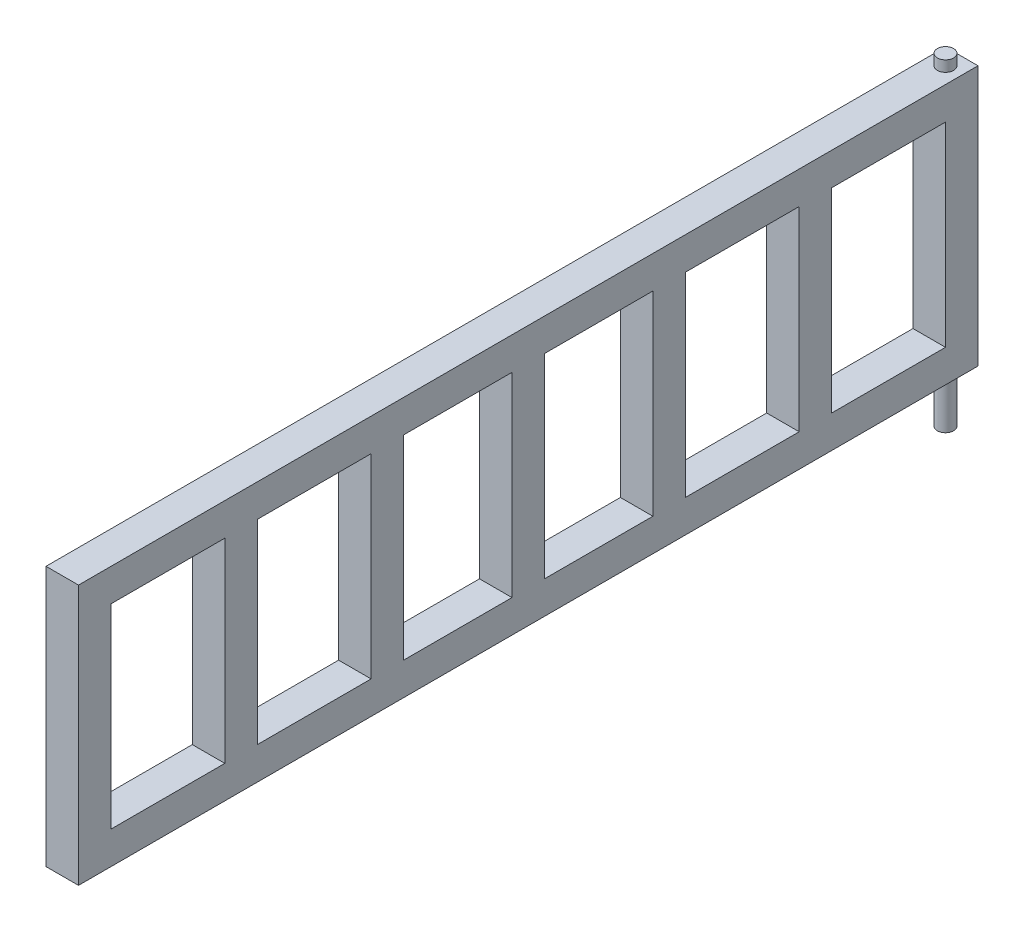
from build123d import *

# Parameters (mm, degrees)
ESQUISSE1_W          = 30
ESQUISSE1_H          = 30
BASE_EXTRUSION_DEPTH = 830
ESQUISSE2_W          = 30
ESQUISSE2_H          = 30
BOSS_EXTRU_1_DEPTH   = 180
ESQUISSE3_W          = 30
ESQUISSE3_H          = 30
BOSS_EXTRU_2_DEPTH   = 180
ESQUISSE4_W          = 30
ESQUISSE4_H          = 830
BOSS_EXTRU_3_DEPTH   = 30
ESQUISSE5_W          = 30
ESQUISSE5_H          = 30
BOSS_EXTRU_4_DEPTH   = 180
ESQUISSE6_W          = 30
ESQUISSE6_H          = 30
BOSS_EXTRU_5_DEPTH   = 180
ESQUISSE7_W          = 30
ESQUISSE7_H          = 30
BOSS_EXTRU_6_DEPTH   = 180
ESQUISSE8_W          = 30
ESQUISSE8_H          = 30
BOSS_EXTRU_7_DEPTH   = 180
ESQUISSE9_W          = 30
ESQUISSE9_H          = 30
BOSS_EXTRU_8_DEPTH   = 180
ESQUISSE12_R         = 7.5
BOSS_EXTRU_11_DEPTH  = 10
BOSS_EXTRU_12_START  = 48
ESQUISSE13_R         = 7.5
BOSS_EXTRU_12_DEPTH  = 48


with BuildPart() as part:
    # Esquisse1 → Base-Extrusion (new body)
    with BuildSketch(Plane.XY):
        with Locations((15, -15)):
            Rectangle(ESQUISSE1_W, ESQUISSE1_H)
    extrude(amount=BASE_EXTRUSION_DEPTH)

    # Esquisse2 → Boss.-Extru.1 (add)
    with BuildSketch(Plane(origin=(0, 0, 0), x_dir=(-1, 0, 0), z_dir=(0, 1, 0))):
        with Locations((-15, 15)):
            Rectangle(ESQUISSE2_W, ESQUISSE2_H)
    extrude(amount=BOSS_EXTRU_1_DEPTH)

    # Esquisse3 → Boss.-Extru.2 (add)
    with BuildSketch(Plane(origin=(0, 0, 0), x_dir=(-1, 0, 0), z_dir=(0, 1, 0))):
        with Locations((-15, 815)):
            Rectangle(ESQUISSE3_W, ESQUISSE3_H)
    extrude(amount=BOSS_EXTRU_2_DEPTH)

    # Esquisse4 → Boss.-Extru.3 (add)
    with BuildSketch(Plane(origin=(0, 180, 0), x_dir=(-1, 0, 0), z_dir=(0, 1, 0))):
        with Locations((-15, 415)):
            Rectangle(ESQUISSE4_W, ESQUISSE4_H)
    extrude(amount=BOSS_EXTRU_3_DEPTH)

    # Esquisse5 → Boss.-Extru.4 (add)
    with BuildSketch(Plane(origin=(0, 0, 0), x_dir=(-1, 0, 0), z_dir=(0, 1, 0))):
        with Locations((-15, 680)):
            Rectangle(ESQUISSE5_W, ESQUISSE5_H)
    extrude(amount=BOSS_EXTRU_4_DEPTH)

    # Esquisse6 → Boss.-Extru.5 (add)
    with BuildSketch(Plane(origin=(0, 0, 0), x_dir=(-1, 0, 0), z_dir=(0, 1, 0))):
        with Locations((-15, 150)):
            Rectangle(ESQUISSE6_W, ESQUISSE6_H)
    extrude(amount=BOSS_EXTRU_5_DEPTH)

    # Esquisse7 → Boss.-Extru.6 (add)
    with BuildSketch(Plane(origin=(0, 0, 0), x_dir=(-1, 0, 0), z_dir=(0, 1, 0))):
        with Locations((-15, 285)):
            Rectangle(ESQUISSE7_W, ESQUISSE7_H)
    extrude(amount=BOSS_EXTRU_6_DEPTH)

    # Esquisse8 → Boss.-Extru.7 (add)
    with BuildSketch(Plane(origin=(0, 0, 0), x_dir=(-1, 0, 0), z_dir=(0, 1, 0))):
        with Locations((-15, 415)):
            Rectangle(ESQUISSE8_W, ESQUISSE8_H)
    extrude(amount=BOSS_EXTRU_7_DEPTH)

    # Esquisse9 → Boss.-Extru.8 (add)
    with BuildSketch(Plane(origin=(0, 0, 0), x_dir=(-1, 0, 0), z_dir=(0, 1, 0))):
        with Locations((-15, 545)):
            Rectangle(ESQUISSE9_W, ESQUISSE9_H)
    extrude(amount=BOSS_EXTRU_8_DEPTH)

    # Esquisse12 → Boss.-Extru.11 (add)
    with BuildSketch(Plane(origin=(0, 210, 0), x_dir=(-1, 0, 0), z_dir=(0, 1, 0))):
        with Locations(Location((-15, 15, 0), (0, 0, 270))):
            Circle(ESQUISSE12_R)
    extrude(amount=BOSS_EXTRU_11_DEPTH)

    # Esquisse13 → Boss.-Extru.12 (add)
    with BuildSketch(Plane.XZ.offset(30).offset(BOSS_EXTRU_12_START)):
        with Locations(Location((15, 15, 0), (0, 0, 270))):
            Circle(ESQUISSE13_R)
    extrude(amount=-BOSS_EXTRU_12_DEPTH)


solid = part.part
